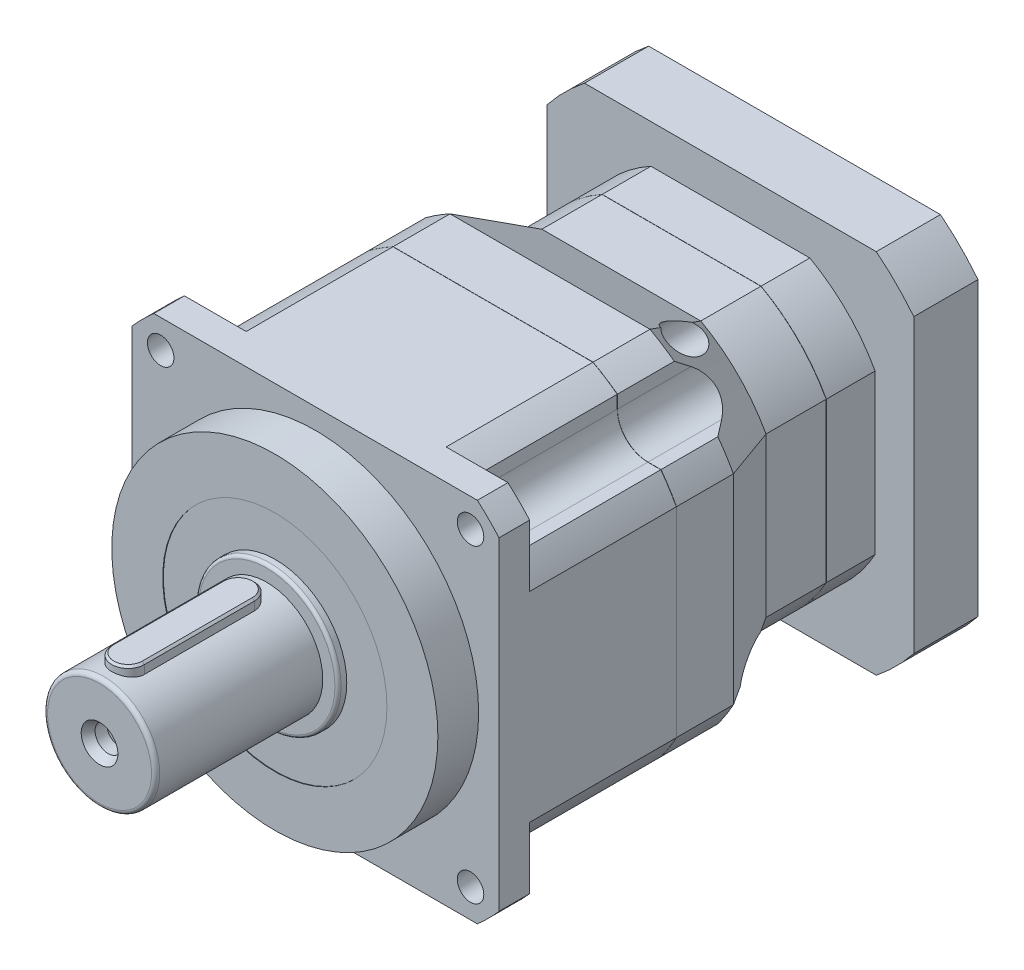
from build123d import *

# Parameters (mm, degrees)
EXTRUDE_1_DEPTH           = 15
SKETCH_2_R                = 80
EXTRUDE_2_DEPTH           = 20
EXTRUDE_3_DEPTH           = 72
SKETCH_4_W                = 43.811250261
SKETCH_4_H                = 36.278094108
CUT_EXTRUDE_1_DEPTH       = 72
PATTERN_CIRCULAR_1_COUNT  = 4
FILLET_1_R                = 15
EXTRUDE_4_DEPTH           = 27.9
EXTRUDE_12_DEPTH          = 29.5
CUT_EXTRUDE_2_DEPTH       = 60
PATTERN_CIRCULAR_2_COUNT  = 4
EXTRUDE_5_DEPTH           = 23.9
EXTRUDE_6_DEPTH           = 31.5
SKETCH_11_R               = 57.15
CUT_EXTRUDE_3_DEPTH       = 8
SKETCH_12_R               = 56.5
CUT_EXTRUDE_4_DEPTH       = 10.5
SKETCH_26_R               = 41.5
CUT_EXTRUDE_10_DEPTH      = 33
SKETCH_27_R               = 37.5
EXTRUDE_13_DEPTH          = 20.5
SKETCH_28_R               = 9
CUT_EXTRUDE_11_DEPTH      = 39.5
PATTERN_CIRCULAR_7_COUNT  = 6
CHAMFER_4_SIZE            = 1
SKETCH_29_R               = 17.5
CUT_EXTRUDE_12_DEPTH      = 85
SKETCH_30_W               = 78.525208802
SKETCH_30_H               = 1
CUT_EXTRUDE_13_DEPTH      = 20.5
PATTERN_CIRCULAR_8_COUNT  = 4
SKETCH_20_R               = 6.5
CUT_EXTRUDE_8_DEPTH       = 15
PATTERN_CIRCULAR_6_COUNT  = 4
SKETCH_21_R               = 35
EXTRUDE_9_DEPTH           = 4
FILLET_3_R                = 1.5
SKETCH_22_R               = 27.5
EXTRUDE_10_DEPTH          = 82
FILLET_4_R                = 2
EXTRUDE_11_DEPTH          = 31.5
CHAMFER_3_SIZE            = 1
CUT_EXTRUDE_START         = -0.3
SKETCH_24_R               = 55
SKETCH_24_R_2             = 35
CUT_EXTRUDE_9_DEPTH       = 0.3
SKETCH_33_R               = 7
EXTRUDE_14_DEPTH          = 9
PATTERN_CIRCULAR_9_COUNT  = 6
SKETCH_34_R               = 8.5
CUT_EXTRUDE_14_DEPTH      = 90
PATTERN_CIRCULAR_10_COUNT = 4
SKETCH_35_R               = 7
EXTRUDE_15_DEPTH          = 9
PATTERN_CIRCULAR_11_COUNT = 4
SKETCH_36_R               = 6.5
CUT_EXTRUDE_15_DEPTH      = 10
SKETCH_37_R               = 9
SKETCH_38_R               = 6.5


with BuildPart() as part:
    # Sketch 1 → Extrude 1 (new body)
    with BuildSketch(Plane.XY):
        with BuildLine():
            Line((-79.372539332, 90), (79.372539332, 90))
            ThreePointArc((79.372539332, 90), (84.852813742, 84.852813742), (90, 79.372539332))
            Line((90, 79.372539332), (90, -79.372539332))
            ThreePointArc((90, -79.372539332), (84.852813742, -84.852813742), (79.372539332, -90))
            Line((79.372539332, -90), (-79.372539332, -90))
            ThreePointArc((-79.372539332, -90), (-84.852813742, -84.852813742), (-90, -79.372539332))
            Line((-90, -79.372539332), (-90, 79.372539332))
            ThreePointArc((-90, 79.372539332), (-84.852813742, 84.852813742), (-79.372539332, 90))
        make_face()
    extrude(amount=EXTRUDE_1_DEPTH)

    # Sketch 2 → Extrude 2 (add)
    with BuildSketch(Plane.XY.offset(15)):
        Circle(SKETCH_2_R)
    extrude(amount=EXTRUDE_2_DEPTH)

    # Sketch 3 → Extrude 3 (add)
    with BuildSketch(Plane(origin=(0, 0, 0), x_dir=(-1, 0, 0), z_dir=(0, 0, -1))):
        with BuildLine():
            Line((-49.053542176, 90), (49.053542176, 90))
            ThreePointArc((49.053542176, 90), (72.478445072, 72.478445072), (90, 49.053542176))
            Line((90, 49.053542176), (90, -49.053542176))
            ThreePointArc((90, -49.053542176), (72.478445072, -72.478445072), (49.053542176, -90))
            Line((49.053542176, -90), (-49.053542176, -90))
            ThreePointArc((-49.053542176, -90), (-72.478445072, -72.478445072), (-90, -49.053542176))
            Line((-90, -49.053542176), (-90, 49.053542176))
            ThreePointArc((-90, 49.053542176), (-72.478445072, 72.478445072), (-49.053542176, 90))
        make_face()
    extrude(amount=EXTRUDE_3_DEPTH)

    # Sketch 4 → Cut-Extrude 1 (cut)
    with BuildSketch(Plane(origin=(0, 0, -72), x_dir=(-1, 0, 0), z_dir=(0, 0, -1))):
        with Locations((-82.905625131, 79.139047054)):
            Rectangle(SKETCH_4_W, SKETCH_4_H)
    cut_extrude_1 = extrude(amount=-CUT_EXTRUDE_1_DEPTH, mode=Mode.SUBTRACT)

    # Pattern Circular 1: Cut-Extrude 1 ×4 about axis
    pattern_circular_1_axis = Axis((0, 0, 0), (0, 0, 1))
    for i in range(1, PATTERN_CIRCULAR_1_COUNT):
        add(cut_extrude_1.rotate(pattern_circular_1_axis, i * 360 / PATTERN_CIRCULAR_1_COUNT), mode=Mode.SUBTRACT)

    # Fillet 1
    fillet_1_edges = [part.edges().sort_by_distance(p)[0] for p in [
        (-61, -61, -36),
        (61, -61, -36),
        (61, 61, -36),
        (-61, 61, -36),
    ]]
    fillet(fillet_1_edges, radius=FILLET_1_R)

    # Sketch 20 → Cut-Extrude 8 (cut)
    with BuildSketch(Plane.XY.offset(15)):
        with Locations((-76.013978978, 76.013978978)):
            Circle(SKETCH_20_R)
    cut_extrude_8 = extrude(amount=-CUT_EXTRUDE_8_DEPTH, mode=Mode.SUBTRACT)

    # Pattern Circular 6: Cut-Extrude 8 ×4 about axis
    pattern_circular_6_axis = Axis((0, 0, 0), (0, 0, 1))
    for i in range(1, PATTERN_CIRCULAR_6_COUNT):
        add(cut_extrude_8.rotate(pattern_circular_6_axis, i * 360 / PATTERN_CIRCULAR_6_COUNT), mode=Mode.SUBTRACT)

    # Sketch 21 → Extrude 9 (add)
    with BuildSketch(Plane.XY.offset(35)):
        Circle(SKETCH_21_R)
    extrude(amount=EXTRUDE_9_DEPTH)

    # Fillet 3
    fillet_3_edges = [part.edges().sort_by_distance(p)[0] for p in [
        (-35, 0, 39),
    ]]
    fillet(fillet_3_edges, radius=FILLET_3_R)

    # Sketch 22 → Extrude 10 (add)
    with BuildSketch(Plane.XY.offset(39)):
        Circle(SKETCH_22_R)
    extrude(amount=EXTRUDE_10_DEPTH)

    # Fillet 4
    fillet_4_edges = [part.edges().sort_by_distance(p)[0] for p in [
        (-27.5, 0, 121),
    ]]
    fillet(fillet_4_edges, radius=FILLET_4_R)

    # Sketch 23 → Extrude 11 (add)
    with BuildSketch(Plane(origin=(0, 0, 0), x_dir=(1, 0, 0), z_dir=(0, 1, 0))):
        with BuildLine():
            Line((-8, -53), (-8, -107))
            ThreePointArc((-8, -107), (0, -115), (8, -107))
            Line((8, -107), (8, -53))
            ThreePointArc((8, -53), (0, -45), (-8, -53))
        make_face()
    extrude(amount=EXTRUDE_11_DEPTH)

    # Chamfer 3
    chamfer_3_edges = [part.edges().sort_by_distance(p)[0] for p in [
        (0, 31.5, 45),
        (-8, 31.5, 80),
        (0, 31.5, 115),
        (8, 31.5, 80),
    ]]
    chamfer(chamfer_3_edges, length=CHAMFER_3_SIZE)

    # Sketch 24 → Cut-Extrude 9 (cut)
    with BuildSketch(Plane.XY.offset(35).offset(CUT_EXTRUDE_START)):
        Circle(SKETCH_24_R)
        Circle(SKETCH_24_R_2, mode=Mode.SUBTRACT)
    extrude(amount=CUT_EXTRUDE_9_DEPTH, mode=Mode.SUBTRACT)

    # Sketch 36 → Cut-Extrude 15 (cut)
    with BuildSketch(Plane.XY.offset(121)):
        Circle(SKETCH_36_R)
    extrude(amount=-CUT_EXTRUDE_15_DEPTH, mode=Mode.SUBTRACT)

    # Sketch 37 → Loft 1 2 section 0
    with BuildSketch(Plane.XY.offset(121)):
        Circle(SKETCH_37_R)
    # Sketch 38 → Loft 1 2 section 1
    with BuildSketch(Plane.XY.offset(116.7)):
        Circle(SKETCH_38_R)
    loft(mode=Mode.SUBTRACT)

    # Sketch 39 → Hole Wizard M12 _3 (revolve, cut)
    with BuildSketch(Plane(origin=(0, 0, 111), x_dir=(0, -1, 0), z_dir=(1, 0, 0))):
        Polygon((0, 0), (0, 41.814389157), (5.1, 38.75), (5.1, 0), align=None)
    revolve(axis=Axis((0, 0, 117.35), (0, 0, -1)), mode=Mode.SUBTRACT)


with BuildPart() as body_2:
    # Sketch 5 → Extrude 4 (new body)
    with BuildSketch(Plane(origin=(0, 0, -72.1), x_dir=(-1, 0, 0), z_dir=(0, 0, -1))):
        with BuildLine():
            Line((-49.053542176, 90), (49.053542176, 90))
            ThreePointArc((49.053542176, 90), (72.478445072, 72.478445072), (90, 49.053542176))
            Line((90, 49.053542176), (90, -49.053542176))
            ThreePointArc((90, -49.053542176), (72.478445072, -72.478445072), (49.053542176, -90))
            Line((49.053542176, -90), (-49.053542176, -90))
            ThreePointArc((-49.053542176, -90), (-72.478445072, -72.478445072), (-90, -49.053542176))
            Line((-90, -49.053542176), (-90, 49.053542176))
            ThreePointArc((-90, 49.053542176), (-72.478445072, 72.478445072), (-49.053542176, 90))
        make_face()
    extrude(amount=EXTRUDE_4_DEPTH)


with BuildPart() as body_3:
    # Sketch 25 → Extrude 12 (new body)
    with BuildSketch(Plane(origin=(0, 0, -135), x_dir=(-1, 0, 0), z_dir=(0, 0, -1))):
        with BuildLine():
            Line((-38.987177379, 71), (38.987177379, 71))
            ThreePointArc((38.987177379, 71), (57.275649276, 57.275649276), (71, 38.987177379))
            Line((71, 38.987177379), (71, -38.987177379))
            ThreePointArc((71, -38.987177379), (57.275649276, -57.275649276), (38.987177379, -71))
            Line((38.987177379, -71), (-38.987177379, -71))
            ThreePointArc((-38.987177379, -71), (-57.275649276, -57.275649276), (-71, -38.987177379))
            Line((-71, -38.987177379), (-71, 38.987177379))
            ThreePointArc((-71, 38.987177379), (-57.275649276, 57.275649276), (-38.987177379, 71))
        make_face()
    extrude(amount=EXTRUDE_12_DEPTH)


    add(body_2.part)  # loft_1 joins it to this body
    # loft from a face of the part (loft_1)
    loft([body_3.faces().sort_by_distance((0, 0, -135))[0], body_3.faces().sort_by_distance((0, 0, -100))[0]])

    # Sketch 7 → Cut-Extrude 2 (cut)
    with BuildSketch(Plane.XY.offset(-72.1)):
        with BuildLine():
            Line((61, 76), (61, 82.372628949))
            ThreePointArc((61, 82.372628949), (72.478445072, 72.478445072), (82.372628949, 61))
            Line((82.372628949, 61), (76, 61))
            ThreePointArc((76, 61), (65.393398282, 65.393398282), (61, 76))
        make_face()
    cut_extrude_2 = extrude(amount=-CUT_EXTRUDE_2_DEPTH, mode=Mode.SUBTRACT)

    # Pattern Circular 2: Cut-Extrude 2 ×4 about axis
    pattern_circular_2_axis = Axis((0, 0, 0), (0, 0, 1))
    for i in range(1, PATTERN_CIRCULAR_2_COUNT):
        add(cut_extrude_2.rotate(pattern_circular_2_axis, i * 360 / PATTERN_CIRCULAR_2_COUNT), mode=Mode.SUBTRACT)


with BuildPart() as body_3_2:
    # Sketch 8 → Extrude 5 (new body)
    with BuildSketch(Plane(origin=(0, 0, -164.6), x_dir=(-1, 0, 0), z_dir=(0, 0, -1))):
        with BuildLine():
            Line((38.987177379, 71), (-38.987177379, 71))
            ThreePointArc((-38.987177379, 71), (-57.275649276, 57.275649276), (-71, 38.987177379))
            Line((-71, 38.987177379), (-71, -38.987177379))
            ThreePointArc((-71, -38.987177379), (-57.275649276, -57.275649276), (-38.987177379, -71))
            Line((-38.987177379, -71), (38.987177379, -71))
            ThreePointArc((38.987177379, -71), (57.275649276, -57.275649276), (71, -38.987177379))
            Line((71, -38.987177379), (71, 38.987177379))
            ThreePointArc((71, 38.987177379), (57.275649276, 57.275649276), (38.987177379, 71))
        make_face()
    extrude(amount=EXTRUDE_5_DEPTH)

    # Sketch 9 → Extrude 6 (add)
    with BuildSketch(Plane(origin=(0, 0, -188.5), x_dir=(-1, 0, 0), z_dir=(0, 0, -1))):
        with BuildLine():
            Line((-71.589105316, 90), (71.589105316, 90))
            ThreePointArc((71.589105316, 90), (81.317279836, 81.317279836), (90, 71.589105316))
            Line((90, 71.589105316), (90, -71.589105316))
            ThreePointArc((90, -71.589105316), (81.317279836, -81.317279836), (71.589105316, -90))
            Line((71.589105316, -90), (-71.589105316, -90))
            ThreePointArc((-71.589105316, -90), (-81.317279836, -81.317279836), (-90, -71.589105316))
            Line((-90, -71.589105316), (-90, 71.589105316))
            ThreePointArc((-90, 71.589105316), (-81.317279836, 81.317279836), (-71.589105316, 90))
        make_face()
    extrude(amount=EXTRUDE_6_DEPTH)

    # Sketch 11 → Cut-Extrude 3 (cut)
    with BuildSketch(Plane(origin=(0, 0, -220), x_dir=(-1, 0, 0), z_dir=(0, 0, -1))):
        Circle(SKETCH_11_R)
    extrude(amount=-CUT_EXTRUDE_3_DEPTH, mode=Mode.SUBTRACT)

    # Sketch 12 → Cut-Extrude 4 (cut)
    with BuildSketch(Plane(origin=(0, 0, -212), x_dir=(-1, 0, 0), z_dir=(0, 0, -1))):
        Circle(SKETCH_12_R)
    extrude(amount=-CUT_EXTRUDE_4_DEPTH, mode=Mode.SUBTRACT)

    # Sketch 26 → Cut-Extrude 10 (cut)
    with BuildSketch(Plane(origin=(0, 0, -201.5), x_dir=(-1, 0, 0), z_dir=(0, 0, -1))):
        Circle(SKETCH_26_R)
    extrude(amount=-CUT_EXTRUDE_10_DEPTH, mode=Mode.SUBTRACT)

    # Sketch 27 → Extrude 13 (add)
    with BuildSketch(Plane(origin=(0, 0, -189), x_dir=(-1, 0, 0), z_dir=(0, 0, -1))):
        Circle(SKETCH_27_R)
    extrude(amount=-EXTRUDE_13_DEPTH)

    # Sketch 28 → Cut-Extrude 11 (cut)
    with BuildSketch(Plane(origin=(0, 0, -220), x_dir=(-1, 0, 0), z_dir=(0, 0, -1))):
        with Locations((-27.5, -47.631397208)):
            Circle(SKETCH_28_R)
    cut_extrude_11 = extrude(amount=-CUT_EXTRUDE_11_DEPTH, mode=Mode.SUBTRACT)

    # Pattern Circular 7: Cut-Extrude 11 ×6 about axis
    pattern_circular_7_axis = Axis((0, 0, 0), (0, 0, 1))
    for i in range(1, PATTERN_CIRCULAR_7_COUNT):
        add(cut_extrude_11.rotate(pattern_circular_7_axis, i * 360 / PATTERN_CIRCULAR_7_COUNT), mode=Mode.SUBTRACT)

    # Chamfer 4
    chamfer_4_edges = [body_3_2.edges().sort_by_distance(p)[0] for p in [
        (37.5, 0, -189),
    ]]
    chamfer(chamfer_4_edges, length=CHAMFER_4_SIZE)


with BuildPart() as cut_extrude_12_tool:
    # Sketch 29 → Cut-Extrude 12 (new body)
    with BuildSketch(Plane(origin=(0, 0, -220), x_dir=(-1, 0, 0), z_dir=(0, 0, -1))):
        Circle(SKETCH_29_R)
    extrude(amount=-CUT_EXTRUDE_12_DEPTH)


with BuildPart() as body_3_1:
    add(body_3.part)

    # Cut-Extrude 12: cut by cut_extrude_12_tool
    add(cut_extrude_12_tool.part, mode=Mode.SUBTRACT)

    # Sketch 34 → Cut-Extrude 14 (cut)
    with BuildSketch(Plane(origin=(0, 0, -89), x_dir=(-1, 0, 0), z_dir=(0, 0, -1))):
        with Locations(Location((-48.487612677, 77.596400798, 0), (0, 0, 79.281961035))):
            Circle(SKETCH_34_R)
    cut_extrude_14 = extrude(amount=CUT_EXTRUDE_14_DEPTH, mode=Mode.SUBTRACT)

    # Pattern Circular 10: Cut-Extrude 14 ×4 about axis
    pattern_circular_10_axis = Axis((0, 0, 0), (0, 0, 1))
    for i in range(1, PATTERN_CIRCULAR_10_COUNT):
        add(cut_extrude_14.rotate(pattern_circular_10_axis, i * 360 / PATTERN_CIRCULAR_10_COUNT), mode=Mode.SUBTRACT)

    # Sketch 35 → Extrude 15 (add)
    with BuildSketch(Plane(origin=(0, 0, -89), x_dir=(-1, 0, 0), z_dir=(0, 0, -1))):
        with Locations((-48.487612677, 77.596400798)):
            Circle(SKETCH_35_R)
        Polygon((-46.70150758, 80.564536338), (-50.165040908, 80.627280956), (-51.951146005, 77.659145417), (-50.273717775, 74.628265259), (-46.810184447, 74.56552064), (-45.02407935, 77.53365618), align=None, mode=Mode.SUBTRACT)
    extrude_15 = extrude(amount=EXTRUDE_15_DEPTH)

    # Pattern Circular 11: Extrude 15 ×4 about axis
    pattern_circular_11_axis = Axis((0, 0, 0), (0, 0, 1))
    for i in range(1, PATTERN_CIRCULAR_11_COUNT):
        add(extrude_15.rotate(pattern_circular_11_axis, i * 360 / PATTERN_CIRCULAR_11_COUNT))


with BuildPart() as body_3_2_1:
    add(body_3_2.part)

    # Cut-Extrude 12: cut by cut_extrude_12_tool
    add(cut_extrude_12_tool.part, mode=Mode.SUBTRACT)

    # Sketch 30 → Cut-Extrude 13 (cut)
    with BuildSketch(Plane(origin=(0, 0, -189), x_dir=(-1, 0, 0), z_dir=(0, 0, -1))):
        with Locations((0.135799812, 0)):
            Rectangle(SKETCH_30_W, SKETCH_30_H)
    extrude(amount=-CUT_EXTRUDE_13_DEPTH, mode=Mode.SUBTRACT)

    # Sketch 32 → Hole Wizard M12 _2 (revolve, cut)
    with BuildSketch(Plane(origin=(70.710678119, -70.710678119, -220), x_dir=(0, 1, 0), z_dir=(1, 0, 0))):
        Polygon((0, 0), (0, 30.064389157), (5.1, 27), (5.1, 0), align=None)
    hole_wizard_m12_2 = revolve(axis=Axis((70.710678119, -70.710678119, -226.35), (0, 0, 1)), mode=Mode.SUBTRACT)

    # Pattern Circular 8: Hole Wizard M12 _2 ×4 about axis
    pattern_circular_8_axis = Axis((0, 0, 0), (0, 0, 1))
    for i in range(1, PATTERN_CIRCULAR_8_COUNT):
        add(hole_wizard_m12_2.rotate(pattern_circular_8_axis, i * 360 / PATTERN_CIRCULAR_8_COUNT), mode=Mode.SUBTRACT)

    # Sketch 33 → Extrude 14 (add)
    with BuildSketch(Plane(origin=(0, 0, -180.5), x_dir=(-1, 0, 0), z_dir=(0, 0, -1))):
        with Locations((-55, 0)):
            Circle(SKETCH_33_R)
        Polygon((-53.361741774, 3.113742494), (-56.877450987, 2.975644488), (-58.515709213, -0.138098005), (-56.638258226, -3.113742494), (-53.122549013, -2.975644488), (-51.484290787, 0.138098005), align=None, mode=Mode.SUBTRACT)
    extrude_14 = extrude(amount=EXTRUDE_14_DEPTH)

    # Pattern Circular 9: Extrude 14 ×6 about axis
    pattern_circular_9_axis = Axis((0, 0, 0), (0, 0, 1))
    for i in range(1, PATTERN_CIRCULAR_9_COUNT):
        add(extrude_14.rotate(pattern_circular_9_axis, i * 360 / PATTERN_CIRCULAR_9_COUNT))


solid = Compound([part.part, body_3_1.part, body_3_2_1.part])
